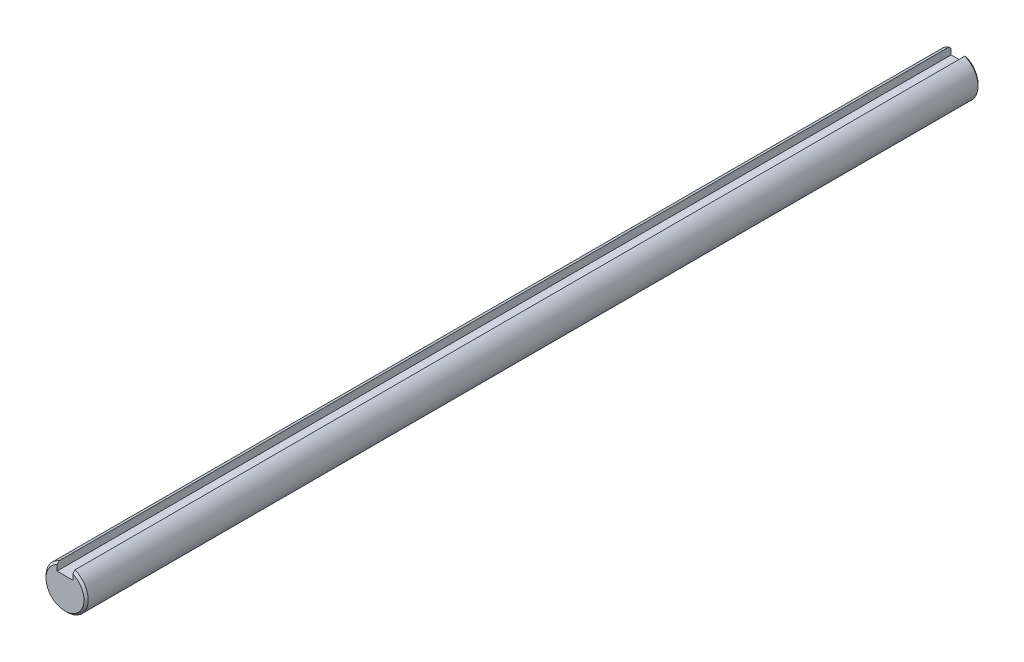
from build123d import *

# Parameters (mm, degrees)
BOSS_EXTRUDE2_DEPTH      = 67.31
BOSS_EXTRUDE2_DEPTH_BACK = 67.31
SKETCH3_R                = 3.175
CUT_EXTRUDE5_DEPTH       = 68.459597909
CUT_EXTRUDE5_DEPTH_BACK  = 68.459597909
SKETCH10_W               = 2.38125
SKETCH10_H               = 1.422321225
CHAMFER1_SIZE            = 0.3175


with BuildPart() as part:
    # Sketch3 → Boss-Extrude2 (new, two sides: drawn at the far end of the back side and taken through both)
    with BuildSketch(Plane.XY.offset(-BOSS_EXTRUDE2_DEPTH_BACK)):
        Circle(SKETCH3_R)
    extrude(amount=BOSS_EXTRUDE2_DEPTH + BOSS_EXTRUDE2_DEPTH_BACK)

    # Sketch10 → Cut-Extrude5 (cut, two sides: drawn at the far end of the back side and taken through both)
    with BuildSketch(Plane.XY.offset(-CUT_EXTRUDE5_DEPTH_BACK)):
        with Locations((0, 2.463839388)):
            Rectangle(SKETCH10_W, SKETCH10_H)
    extrude(amount=CUT_EXTRUDE5_DEPTH + CUT_EXTRUDE5_DEPTH_BACK, mode=Mode.SUBTRACT)

    # Chamfer1
    chamfer1_edges = [part.edges().sort_by_distance(p)[0] for p in [
        (0, -3.175, 67.31),
        (0, -3.175, -67.31),
    ]]
    chamfer(chamfer1_edges, length=CHAMFER1_SIZE)


solid = part.part
